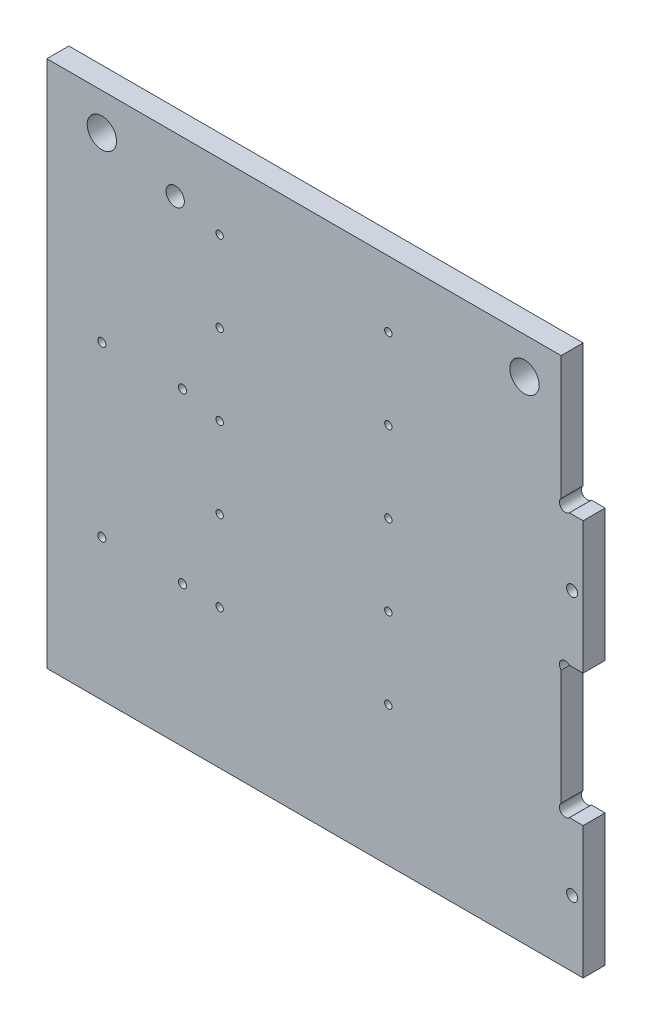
from build123d import *

# Parameters (mm, degrees)
EXTRUSION1_DEPTH        = 6
ESQUISSE2_R             = 1.6
ENL_V_MAT_EXTRU_1_DEPTH = 206.331591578
ESQUISSE3_R             = 4
ENL_V_MAT_EXTRU_2_DEPTH = 206.331591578
ESQUISSE4_R             = 1
ESQUISSE4_R_2           = 1.5
ENL_V_MAT_EXTRU_3_DEPTH = 206.331591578
ESQUISSE5_R             = 1.1
ENL_V_MAT_EXTRU_4_DEPTH = 206.331591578
ESQUISSE6_R             = 2.5
ENL_V_MAT_EXTRU_5_DEPTH = 206.331591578


with BuildPart() as part:
    # Esquisse1 → Extrusion1 (new body)
    with BuildSketch(Plane.XY):
        Polygon((0, 0), (0, 144), (140.25, 144), (140.25, 108), (146.25, 108), (146.25, 72), (140.25, 72), (140.25, 36), (146.25, 36), (146.25, 0), align=None)
    extrude(amount=EXTRUSION1_DEPTH)

    # Esquisse2 → Enl_v. mat.-Extru.1 (cut, through all)
    with BuildSketch(Plane.XY.offset(6)):
        with Locations((141.38137085, 109.13137085)):
            Circle(ESQUISSE2_R)
        with Locations((141.38137085, 70.86862915)):
            Circle(ESQUISSE2_R)
        with Locations((141.38137085, 37.13137085)):
            Circle(ESQUISSE2_R)
    extrude(amount=-ENL_V_MAT_EXTRU_1_DEPTH, mode=Mode.SUBTRACT)

    # Esquisse3 → Enl_v. mat.-Extru.2 (cut, through all)
    with BuildSketch(Plane.XY.offset(6)):
        with Locations((15, 134)):
            Circle(ESQUISSE3_R)
        with Locations((130.25, 134)):
            Circle(ESQUISSE3_R)
    extrude(amount=-ENL_V_MAT_EXTRU_2_DEPTH, mode=Mode.SUBTRACT)

    # Esquisse4 → Enl_v. mat.-Extru.3 (cut, through all)
    with BuildSketch(Plane.XY.offset(6)):
        with Locations((93.125, 126)):
            Circle(ESQUISSE4_R)
        with Locations((47.125, 126)):
            Circle(ESQUISSE4_R)
        with Locations((47.125, 104)):
            Circle(ESQUISSE4_R)
        with Locations((47.125, 82)):
            Circle(ESQUISSE4_R)
        with Locations((47.125, 60)):
            Circle(ESQUISSE4_R)
        with Locations((93.125, 60)):
            Circle(ESQUISSE4_R)
        with Locations((93.125, 82)):
            Circle(ESQUISSE4_R)
        with Locations((93.125, 104)):
            Circle(ESQUISSE4_R)
        with Locations((93.125, 38)):
            Circle(ESQUISSE4_R)
        with Locations((47.125, 38)):
            Circle(ESQUISSE4_R)
        with Locations((143.25, 90)):
            Circle(ESQUISSE4_R_2)
        with Locations((143.25, 18)):
            Circle(ESQUISSE4_R_2)
    extrude(amount=-ENL_V_MAT_EXTRU_3_DEPTH, mode=Mode.SUBTRACT)

    # Esquisse5 → Enl_v. mat.-Extru.4 (cut, through all)
    with BuildSketch(Plane(origin=(0, 0, 0), x_dir=(-1, 0, 0), z_dir=(0, 0, -1))):
        with Locations((-15, 84.5)):
            Circle(ESQUISSE5_R)
        with Locations((-37, 84.5)):
            Circle(ESQUISSE5_R)
        with Locations((-37, 38.5)):
            Circle(ESQUISSE5_R)
        with Locations((-15, 38.5)):
            Circle(ESQUISSE5_R)
    extrude(amount=-ENL_V_MAT_EXTRU_4_DEPTH, mode=Mode.SUBTRACT)

    # Esquisse6 → Enl_v. mat.-Extru.5 (cut, through all)
    with BuildSketch(Plane(origin=(0, 0, 0), x_dir=(-1, 0, 0), z_dir=(0, 0, -1))):
        with Locations((-35, 129)):
            Circle(ESQUISSE6_R)
    extrude(amount=-ENL_V_MAT_EXTRU_5_DEPTH, mode=Mode.SUBTRACT)


solid = part.part
